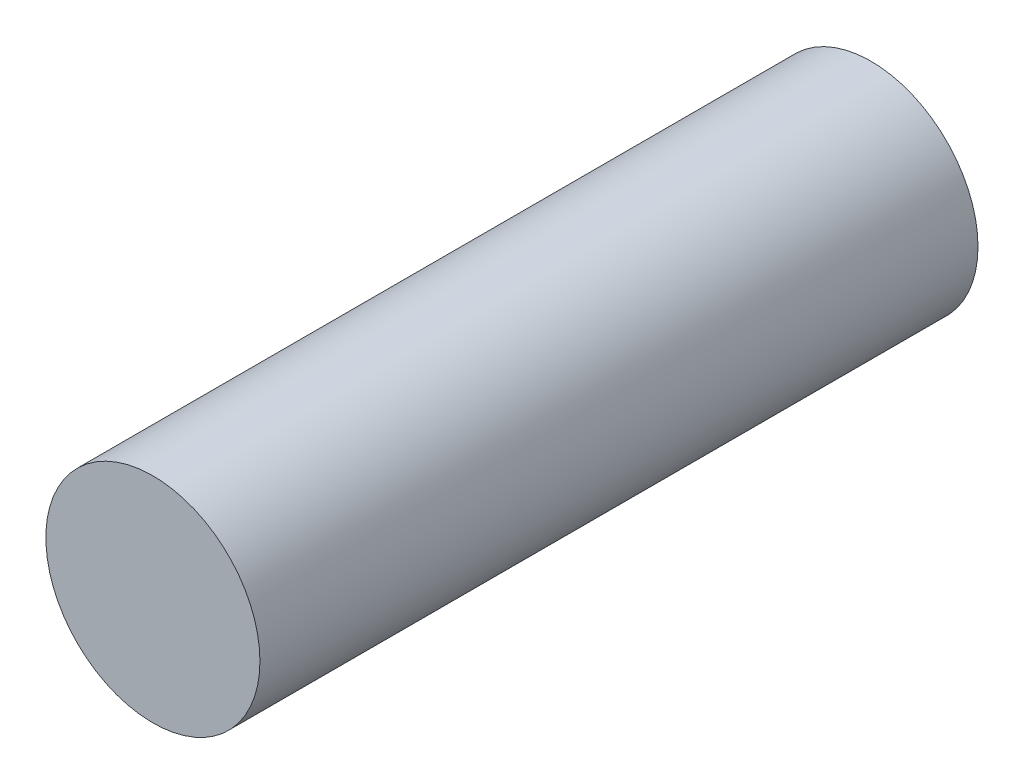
ISO-10303-21;
HEADER;
FILE_DESCRIPTION(('STEP AP214'),'2;1');
FILE_NAME('part.step','',(''),(''),'','','');
FILE_SCHEMA(('AUTOMOTIVE_DESIGN { 1 0 10303 214 1 1 1 1 }'));
ENDSEC;
DATA;
#1=APPLICATION_CONTEXT('core data for automotive mechanical design processes');
#2=APPLICATION_PROTOCOL_DEFINITION('international standard','automotive_design',2000,#1);
#3=PRODUCT_CONTEXT('',#1,'mechanical');
#4=PRODUCT('Part','Part','',(#3));
#5=PRODUCT_RELATED_PRODUCT_CATEGORY('part','',(#4));
#6=PRODUCT_DEFINITION_FORMATION('','',#4);
#7=PRODUCT_DEFINITION_CONTEXT('part definition',#1,'design');
#8=PRODUCT_DEFINITION('design','',#6,#7);
#9=PRODUCT_DEFINITION_SHAPE('','',#8);
#10=(LENGTH_UNIT() NAMED_UNIT(*) SI_UNIT(.MILLI.,.METRE.));
#11=(NAMED_UNIT(*) PLANE_ANGLE_UNIT() SI_UNIT($,.RADIAN.));
#12=(NAMED_UNIT(*) SI_UNIT($,.STERADIAN.) SOLID_ANGLE_UNIT());
#13=UNCERTAINTY_MEASURE_WITH_UNIT(LENGTH_MEASURE(1.E-05),#10,'distance_accuracy_value','');
#14=(GEOMETRIC_REPRESENTATION_CONTEXT(3) GLOBAL_UNCERTAINTY_ASSIGNED_CONTEXT((#13)) GLOBAL_UNIT_ASSIGNED_CONTEXT((#10,
#11,#12)) REPRESENTATION_CONTEXT('',''));
#15=CARTESIAN_POINT('',(0.,0.,0.));
#16=DIRECTION('',(0.,0.,1.));
#17=DIRECTION('',(1.,0.,0.));
#18=AXIS2_PLACEMENT_3D('',#15,#16,#17);
#19=CARTESIAN_POINT('',(0.,0.,70.1));
#20=DIRECTION('',(0.,0.,-1.));
#21=DIRECTION('',(-1.,0.,0.));
#22=AXIS2_PLACEMENT_3D('',#19,#20,#21);
#23=CYLINDRICAL_SURFACE('',#22,10.45);
#24=CARTESIAN_POINT('',(0.,0.,70.1));
#25=DIRECTION('',(0.,0.,1.));
#26=DIRECTION('',(1.,0.,0.));
#27=AXIS2_PLACEMENT_3D('',#24,#25,#26);
#28=CIRCLE('',#27,10.45);
#29=CARTESIAN_POINT('',(10.45,0.,70.1));
#30=VERTEX_POINT('',#29);
#31=EDGE_CURVE('E10',#30,#30,#28,.T.);
#32=ORIENTED_EDGE('',*,*,#31,.F.);
#33=EDGE_LOOP('',(#32));
#34=FACE_BOUND('',#33,.T.);
#35=CARTESIAN_POINT('',(0.,0.,0.));
#36=DIRECTION('',(0.,0.,1.));
#37=DIRECTION('',(1.,0.,0.));
#38=AXIS2_PLACEMENT_3D('',#35,#36,#37);
#39=CIRCLE('',#38,10.45);
#40=CARTESIAN_POINT('',(10.45,0.,0.));
#41=VERTEX_POINT('',#40);
#42=EDGE_CURVE('E45',#41,#41,#39,.T.);
#43=ORIENTED_EDGE('',*,*,#42,.T.);
#44=EDGE_LOOP('',(#43));
#45=FACE_BOUND('',#44,.T.);
#46=ADVANCED_FACE('F39',(#34,#45),#23,.T.);
#47=CARTESIAN_POINT('',(0.,0.,70.1));
#48=DIRECTION('',(0.,0.,1.));
#49=DIRECTION('',(1.,0.,0.));
#50=AXIS2_PLACEMENT_3D('',#47,#48,#49);
#51=PLANE('',#50);
#52=ORIENTED_EDGE('',*,*,#31,.T.);
#53=EDGE_LOOP('',(#52));
#54=FACE_BOUND('',#53,.T.);
#55=ADVANCED_FACE('F53',(#54),#51,.T.);
#56=CARTESIAN_POINT('',(0.,0.,0.));
#57=DIRECTION('',(0.,0.,1.));
#58=DIRECTION('',(1.,0.,0.));
#59=AXIS2_PLACEMENT_3D('',#56,#57,#58);
#60=PLANE('',#59);
#61=ORIENTED_EDGE('',*,*,#42,.F.);
#62=EDGE_LOOP('',(#61));
#63=FACE_BOUND('',#62,.T.);
#64=ADVANCED_FACE('F55',(#63),#60,.F.);
#65=CLOSED_SHELL('',(#46,#55,#64));
#66=MANIFOLD_SOLID_BREP('B2',#65);
#67=ADVANCED_BREP_SHAPE_REPRESENTATION('',(#18,#66),#14);
#68=SHAPE_DEFINITION_REPRESENTATION(#9,#67);
ENDSEC;
END-ISO-10303-21;
